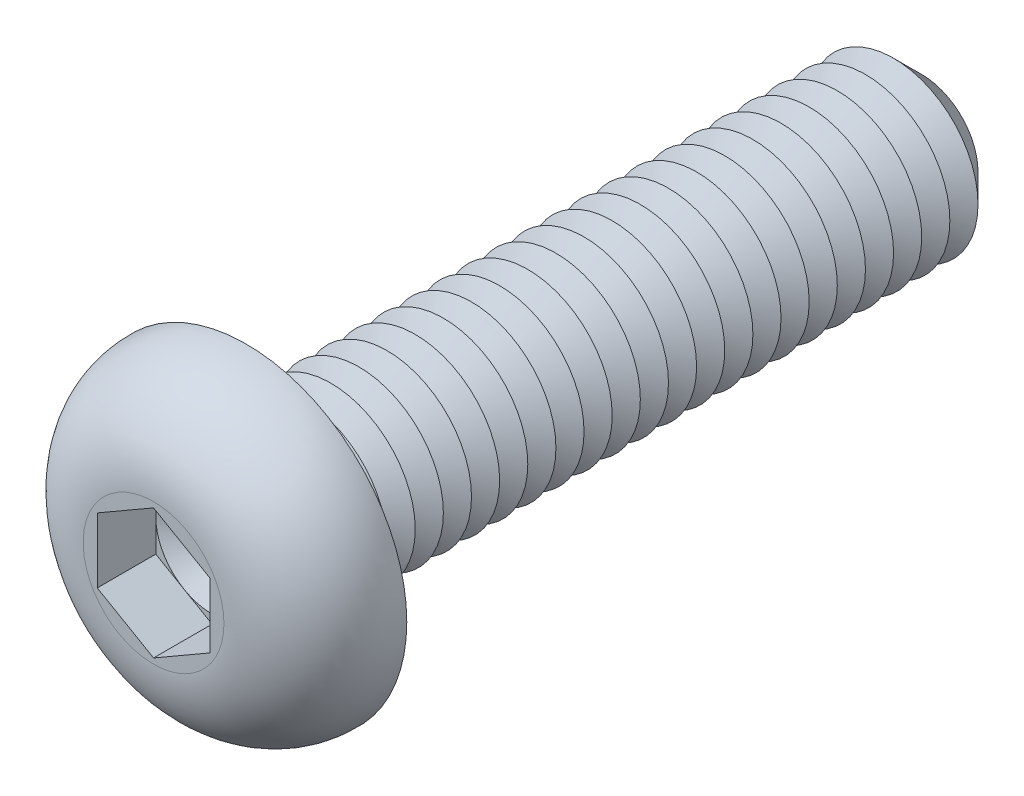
ISO-10303-21;
HEADER;
FILE_DESCRIPTION(('STEP AP214'),'2;1');
FILE_NAME('part.step','',(''),(''),'','','');
FILE_SCHEMA(('AUTOMOTIVE_DESIGN { 1 0 10303 214 1 1 1 1 }'));
ENDSEC;
DATA;
#1=APPLICATION_CONTEXT('core data for automotive mechanical design processes');
#2=APPLICATION_PROTOCOL_DEFINITION('international standard','automotive_design',2000,#1);
#3=PRODUCT_CONTEXT('',#1,'mechanical');
#4=PRODUCT('Part','Part','',(#3));
#5=PRODUCT_RELATED_PRODUCT_CATEGORY('part','',(#4));
#6=PRODUCT_DEFINITION_FORMATION('','',#4);
#7=PRODUCT_DEFINITION_CONTEXT('part definition',#1,'design');
#8=PRODUCT_DEFINITION('design','',#6,#7);
#9=PRODUCT_DEFINITION_SHAPE('','',#8);
#10=(LENGTH_UNIT() NAMED_UNIT(*) SI_UNIT(.MILLI.,.METRE.));
#11=(NAMED_UNIT(*) PLANE_ANGLE_UNIT() SI_UNIT($,.RADIAN.));
#12=(NAMED_UNIT(*) SI_UNIT($,.STERADIAN.) SOLID_ANGLE_UNIT());
#13=UNCERTAINTY_MEASURE_WITH_UNIT(LENGTH_MEASURE(1.E-05),#10,'distance_accuracy_value','');
#14=(GEOMETRIC_REPRESENTATION_CONTEXT(3) GLOBAL_UNCERTAINTY_ASSIGNED_CONTEXT((#13)) GLOBAL_UNIT_ASSIGNED_CONTEXT((#10,
#11,#12)) REPRESENTATION_CONTEXT('',''));
#15=CARTESIAN_POINT('',(0.,0.,0.));
#16=DIRECTION('',(0.,0.,1.));
#17=DIRECTION('',(1.,0.,0.));
#18=AXIS2_PLACEMENT_3D('',#15,#16,#17);
#19=CARTESIAN_POINT('',(0.,0.,0.61));
#20=DIRECTION('',(0.,0.,1.));
#21=DIRECTION('',(1.,0.,0.));
#22=AXIS2_PLACEMENT_3D('',#19,#20,#21);
#23=PLANE('',#22);
#24=CARTESIAN_POINT('',(0.,0.,0.61));
#25=DIRECTION('',(0.,0.,1.));
#26=DIRECTION('',(1.,0.,0.));
#27=AXIS2_PLACEMENT_3D('',#24,#25,#26);
#28=CIRCLE('',#27,1.);
#29=CARTESIAN_POINT('',(1.,0.,0.61));
#30=VERTEX_POINT('',#29);
#31=CARTESIAN_POINT('',(0.5,0.866025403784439,0.61));
#32=VERTEX_POINT('',#31);
#33=EDGE_CURVE('E117',#30,#32,#28,.T.);
#34=ORIENTED_EDGE('',*,*,#33,.F.);
#35=DIRECTION('',(0.,1.,0.));
#36=VECTOR('',#35,1.);
#37=CARTESIAN_POINT('',(1.,-0.577350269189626,0.61));
#38=LINE('',#37,#36);
#39=CARTESIAN_POINT('',(1.,0.577350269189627,0.61));
#40=VERTEX_POINT('',#39);
#41=EDGE_CURVE('E140',#30,#40,#38,.T.);
#42=ORIENTED_EDGE('',*,*,#41,.T.);
#43=DIRECTION('',(-0.866025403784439,0.5,0.));
#44=VECTOR('',#43,1.);
#45=CARTESIAN_POINT('',(1.,0.577350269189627,0.61));
#46=LINE('',#45,#44);
#47=EDGE_CURVE('E135',#40,#32,#46,.T.);
#48=ORIENTED_EDGE('',*,*,#47,.T.);
#49=EDGE_LOOP('',(#34,#42,#48));
#50=FACE_BOUND('',#49,.T.);
#51=ADVANCED_FACE('F39',(#50),#23,.T.);
#52=CARTESIAN_POINT('',(0.,0.,0.61));
#53=DIRECTION('',(0.,0.,1.));
#54=DIRECTION('',(1.,0.,0.));
#55=AXIS2_PLACEMENT_3D('',#52,#53,#54);
#56=CIRCLE('',#55,1.);
#57=CARTESIAN_POINT('',(-0.5,0.866025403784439,0.61));
#58=VERTEX_POINT('',#57);
#59=EDGE_CURVE('E11',#32,#58,#56,.T.);
#60=ORIENTED_EDGE('',*,*,#59,.F.);
#61=CARTESIAN_POINT('',(0.,1.15470053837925,0.61));
#62=VERTEX_POINT('',#61);
#63=EDGE_CURVE('E130',#32,#62,#46,.T.);
#64=ORIENTED_EDGE('',*,*,#63,.T.);
#65=DIRECTION('',(-0.866025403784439,-0.5,0.));
#66=VECTOR('',#65,1.);
#67=CARTESIAN_POINT('',(0.,1.15470053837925,0.61));
#68=LINE('',#67,#66);
#69=EDGE_CURVE('E132',#62,#58,#68,.T.);
#70=ORIENTED_EDGE('',*,*,#69,.T.);
#71=EDGE_LOOP('',(#60,#64,#70));
#72=FACE_BOUND('',#71,.T.);
#73=ADVANCED_FACE('F129',(#72),#23,.T.);
#74=CARTESIAN_POINT('',(-1.,0.,0.61));
#75=VERTEX_POINT('',#74);
#76=EDGE_CURVE('E49',#58,#75,#56,.T.);
#77=ORIENTED_EDGE('',*,*,#76,.F.);
#78=CARTESIAN_POINT('',(-1.,0.577350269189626,0.61));
#79=VERTEX_POINT('',#78);
#80=EDGE_CURVE('E143',#58,#79,#68,.T.);
#81=ORIENTED_EDGE('',*,*,#80,.T.);
#82=DIRECTION('',(0.,-1.,0.));
#83=VECTOR('',#82,1.);
#84=CARTESIAN_POINT('',(-1.,0.577350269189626,0.61));
#85=LINE('',#84,#83);
#86=EDGE_CURVE('E154',#79,#75,#85,.T.);
#87=ORIENTED_EDGE('',*,*,#86,.T.);
#88=EDGE_LOOP('',(#77,#81,#87));
#89=FACE_BOUND('',#88,.T.);
#90=ADVANCED_FACE('F252',(#89),#23,.T.);
#91=CARTESIAN_POINT('',(-0.5,-0.866025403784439,0.61));
#92=VERTEX_POINT('',#91);
#93=EDGE_CURVE('E233',#75,#92,#56,.T.);
#94=ORIENTED_EDGE('',*,*,#93,.F.);
#95=CARTESIAN_POINT('',(-1.,-0.577350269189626,0.61));
#96=VERTEX_POINT('',#95);
#97=EDGE_CURVE('E153',#75,#96,#85,.T.);
#98=ORIENTED_EDGE('',*,*,#97,.T.);
#99=DIRECTION('',(0.866025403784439,-0.5,0.));
#100=VECTOR('',#99,1.);
#101=CARTESIAN_POINT('',(-1.,-0.577350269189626,0.61));
#102=LINE('',#101,#100);
#103=EDGE_CURVE('E159',#96,#92,#102,.T.);
#104=ORIENTED_EDGE('',*,*,#103,.T.);
#105=EDGE_LOOP('',(#94,#98,#104));
#106=FACE_BOUND('',#105,.T.);
#107=ADVANCED_FACE('F245',(#106),#23,.T.);
#108=CARTESIAN_POINT('',(0.5,-0.866025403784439,0.61));
#109=VERTEX_POINT('',#108);
#110=EDGE_CURVE('E56',#92,#109,#56,.T.);
#111=ORIENTED_EDGE('',*,*,#110,.F.);
#112=CARTESIAN_POINT('',(0.,-1.15470053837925,0.61));
#113=VERTEX_POINT('',#112);
#114=EDGE_CURVE('E158',#92,#113,#102,.T.);
#115=ORIENTED_EDGE('',*,*,#114,.T.);
#116=DIRECTION('',(0.866025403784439,0.5,0.));
#117=VECTOR('',#116,1.);
#118=CARTESIAN_POINT('',(0.,-1.15470053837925,0.61));
#119=LINE('',#118,#117);
#120=EDGE_CURVE('E164',#113,#109,#119,.T.);
#121=ORIENTED_EDGE('',*,*,#120,.T.);
#122=EDGE_LOOP('',(#111,#115,#121));
#123=FACE_BOUND('',#122,.T.);
#124=ADVANCED_FACE('F461',(#123),#23,.T.);
#125=CARTESIAN_POINT('',(0.,0.,-12.));
#126=DIRECTION('',(0.,0.,1.));
#127=DIRECTION('',(1.,0.,0.));
#128=AXIS2_PLACEMENT_3D('',#125,#126,#127);
#129=CYLINDRICAL_SURFACE('',#128,1.5);
#130=CARTESIAN_POINT('',(0.,0.,-0.200000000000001));
#131=DIRECTION('',(0.,0.,1.));
#132=DIRECTION('',(1.,0.,0.));
#133=AXIS2_PLACEMENT_3D('',#130,#131,#132);
#134=CIRCLE('',#133,1.5);
#135=CARTESIAN_POINT('',(1.5,0.,-0.200000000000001));
#136=VERTEX_POINT('',#135);
#137=EDGE_CURVE('E221',#136,#136,#134,.F.);
#138=ORIENTED_EDGE('',*,*,#137,.T.);
#139=EDGE_LOOP('',(#138));
#140=FACE_BOUND('',#139,.T.);
#141=CARTESIAN_POINT('',(0.,0.,-0.5));
#142=DIRECTION('',(0.,0.,1.));
#143=DIRECTION('',(1.,0.,0.));
#144=AXIS2_PLACEMENT_3D('',#141,#142,#143);
#145=CIRCLE('',#144,1.50000000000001);
#146=CARTESIAN_POINT('',(1.50000000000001,0.,-0.5));
#147=VERTEX_POINT('',#146);
#148=EDGE_CURVE('E149',#147,#147,#145,.T.);
#149=ORIENTED_EDGE('',*,*,#148,.T.);
#150=EDGE_LOOP('',(#149));
#151=FACE_BOUND('',#150,.T.);
#152=ADVANCED_FACE('F445',(#140,#151),#129,.T.);
#153=CARTESIAN_POINT('',(0.,2.85,0.));
#154=DIRECTION('',(0.,0.,1.));
#155=DIRECTION('',(1.,0.,0.));
#156=AXIS2_PLACEMENT_3D('',#153,#154,#155);
#157=PLANE('',#156);
#158=CARTESIAN_POINT('',(0.,0.,0.));
#159=DIRECTION('',(0.,0.,1.));
#160=DIRECTION('',(1.,0.,0.));
#161=AXIS2_PLACEMENT_3D('',#158,#159,#160);
#162=CIRCLE('',#161,1.7);
#163=CARTESIAN_POINT('',(1.7,0.,0.));
#164=VERTEX_POINT('',#163);
#165=EDGE_CURVE('E224',#164,#164,#162,.T.);
#166=ORIENTED_EDGE('',*,*,#165,.T.);
#167=EDGE_LOOP('',(#166));
#168=FACE_BOUND('',#167,.T.);
#169=CARTESIAN_POINT('',(0.,0.,0.));
#170=DIRECTION('',(0.,0.,1.));
#171=DIRECTION('',(1.,0.,0.));
#172=AXIS2_PLACEMENT_3D('',#169,#170,#171);
#173=CIRCLE('',#172,2.85);
#174=CARTESIAN_POINT('',(2.85,0.,0.));
#175=VERTEX_POINT('',#174);
#176=EDGE_CURVE('E196',#175,#175,#173,.T.);
#177=ORIENTED_EDGE('',*,*,#176,.F.);
#178=EDGE_LOOP('',(#177));
#179=FACE_BOUND('',#178,.T.);
#180=ADVANCED_FACE('F491',(#168,#179),#157,.F.);
#181=CARTESIAN_POINT('',(0.,0.,1.65));
#182=DIRECTION('',(0.,0.,-1.));
#183=DIRECTION('',(-1.,0.,0.));
#184=AXIS2_PLACEMENT_3D('',#181,#182,#183);
#185=PLANE('',#184);
#186=DIRECTION('',(-0.866025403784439,-0.5,0.));
#187=VECTOR('',#186,1.);
#188=CARTESIAN_POINT('',(0.,1.15470053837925,1.65));
#189=LINE('',#188,#187);
#190=CARTESIAN_POINT('',(0.,1.15470053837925,1.65));
#191=VERTEX_POINT('',#190);
#192=CARTESIAN_POINT('',(-1.,0.577350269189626,1.65));
#193=VERTEX_POINT('',#192);
#194=EDGE_CURVE('E174',#191,#193,#189,.T.);
#195=ORIENTED_EDGE('',*,*,#194,.F.);
#196=DIRECTION('',(-0.866025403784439,0.5,0.));
#197=VECTOR('',#196,1.);
#198=CARTESIAN_POINT('',(1.,0.577350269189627,1.65));
#199=LINE('',#198,#197);
#200=CARTESIAN_POINT('',(1.,0.577350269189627,1.65));
#201=VERTEX_POINT('',#200);
#202=EDGE_CURVE('E64',#201,#191,#199,.T.);
#203=ORIENTED_EDGE('',*,*,#202,.F.);
#204=DIRECTION('',(0.,1.,0.));
#205=VECTOR('',#204,1.);
#206=CARTESIAN_POINT('',(1.,-0.577350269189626,1.65));
#207=LINE('',#206,#205);
#208=CARTESIAN_POINT('',(1.,-0.577350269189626,1.65));
#209=VERTEX_POINT('',#208);
#210=EDGE_CURVE('E138',#209,#201,#207,.T.);
#211=ORIENTED_EDGE('',*,*,#210,.F.);
#212=DIRECTION('',(0.866025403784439,0.5,0.));
#213=VECTOR('',#212,1.);
#214=CARTESIAN_POINT('',(0.,-1.15470053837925,1.65));
#215=LINE('',#214,#213);
#216=CARTESIAN_POINT('',(0.,-1.15470053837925,1.65));
#217=VERTEX_POINT('',#216);
#218=EDGE_CURVE('E186',#217,#209,#215,.T.);
#219=ORIENTED_EDGE('',*,*,#218,.F.);
#220=DIRECTION('',(0.866025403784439,-0.5,0.));
#221=VECTOR('',#220,1.);
#222=CARTESIAN_POINT('',(-1.,-0.577350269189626,1.65));
#223=LINE('',#222,#221);
#224=CARTESIAN_POINT('',(-1.,-0.577350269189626,1.65));
#225=VERTEX_POINT('',#224);
#226=EDGE_CURVE('E182',#225,#217,#223,.T.);
#227=ORIENTED_EDGE('',*,*,#226,.F.);
#228=DIRECTION('',(0.,-1.,0.));
#229=VECTOR('',#228,1.);
#230=CARTESIAN_POINT('',(-1.,0.577350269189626,1.65));
#231=LINE('',#230,#229);
#232=EDGE_CURVE('E178',#193,#225,#231,.T.);
#233=ORIENTED_EDGE('',*,*,#232,.F.);
#234=EDGE_LOOP('',(#195,#203,#211,#219,#227,#233));
#235=FACE_BOUND('',#234,.T.);
#236=CARTESIAN_POINT('',(0.,0.,1.65));
#237=DIRECTION('',(0.,0.,1.));
#238=DIRECTION('',(1.,0.,0.));
#239=AXIS2_PLACEMENT_3D('',#236,#237,#238);
#240=CIRCLE('',#239,1.25078144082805);
#241=CARTESIAN_POINT('',(1.25078144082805,0.,1.65));
#242=VERTEX_POINT('',#241);
#243=EDGE_CURVE('E213',#242,#242,#240,.T.);
#244=ORIENTED_EDGE('',*,*,#243,.T.);
#245=EDGE_LOOP('',(#244));
#246=FACE_BOUND('',#245,.T.);
#247=ADVANCED_FACE('F261',(#235,#246),#185,.F.);
#248=CARTESIAN_POINT('',(0.,0.,0.0499999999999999));
#249=DIRECTION('',(0.,0.,1.));
#250=DIRECTION('',(1.,0.,0.));
#251=AXIS2_PLACEMENT_3D('',#248,#249,#250);
#252=DEGENERATE_TOROIDAL_SURFACE('',#251,1.25078144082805,1.6,.T.);
#253=ORIENTED_EDGE('',*,*,#243,.F.);
#254=EDGE_LOOP('',(#253));
#255=FACE_BOUND('',#254,.T.);
#256=ORIENTED_EDGE('',*,*,#176,.T.);
#257=EDGE_LOOP('',(#256));
#258=FACE_BOUND('',#257,.T.);
#259=ADVANCED_FACE('F485',(#255,#258),#252,.T.);
#260=CARTESIAN_POINT('',(1.,0.577350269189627,0.61));
#261=DIRECTION('',(0.5,0.866025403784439,0.));
#262=DIRECTION('',(-0.866025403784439,0.5,0.));
#263=AXIS2_PLACEMENT_3D('',#260,#261,#262);
#264=PLANE('',#263);
#265=ORIENTED_EDGE('',*,*,#202,.T.);
#266=DIRECTION('',(0.,0.,1.));
#267=VECTOR('',#266,1.);
#268=CARTESIAN_POINT('',(0.,1.15470053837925,0.61));
#269=LINE('',#268,#267);
#270=EDGE_CURVE('E136',#62,#191,#269,.T.);
#271=ORIENTED_EDGE('',*,*,#270,.F.);
#272=ORIENTED_EDGE('',*,*,#63,.F.);
#273=ORIENTED_EDGE('',*,*,#47,.F.);
#274=DIRECTION('',(0.,0.,1.));
#275=VECTOR('',#274,1.);
#276=CARTESIAN_POINT('',(1.,0.577350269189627,0.61));
#277=LINE('',#276,#275);
#278=EDGE_CURVE('E193',#40,#201,#277,.T.);
#279=ORIENTED_EDGE('',*,*,#278,.T.);
#280=EDGE_LOOP('',(#265,#271,#272,#273,#279));
#281=FACE_BOUND('',#280,.T.);
#282=ADVANCED_FACE('F134',(#281),#264,.F.);
#283=CARTESIAN_POINT('',(1.,-0.577350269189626,0.61));
#284=DIRECTION('',(1.,0.,0.));
#285=DIRECTION('',(0.,0.,-1.));
#286=AXIS2_PLACEMENT_3D('',#283,#284,#285);
#287=PLANE('',#286);
#288=ORIENTED_EDGE('',*,*,#210,.T.);
#289=ORIENTED_EDGE('',*,*,#278,.F.);
#290=ORIENTED_EDGE('',*,*,#41,.F.);
#291=CARTESIAN_POINT('',(1.,-0.577350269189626,0.61));
#292=VERTEX_POINT('',#291);
#293=EDGE_CURVE('E168',#292,#30,#38,.T.);
#294=ORIENTED_EDGE('',*,*,#293,.F.);
#295=DIRECTION('',(0.,0.,1.));
#296=VECTOR('',#295,1.);
#297=CARTESIAN_POINT('',(1.,-0.577350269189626,0.61));
#298=LINE('',#297,#296);
#299=EDGE_CURVE('E197',#292,#209,#298,.T.);
#300=ORIENTED_EDGE('',*,*,#299,.T.);
#301=EDGE_LOOP('',(#288,#289,#290,#294,#300));
#302=FACE_BOUND('',#301,.T.);
#303=ADVANCED_FACE('F469',(#302),#287,.F.);
#304=CARTESIAN_POINT('',(0.,-1.15470053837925,0.61));
#305=DIRECTION('',(0.5,-0.866025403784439,0.));
#306=DIRECTION('',(0.866025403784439,0.5,0.));
#307=AXIS2_PLACEMENT_3D('',#304,#305,#306);
#308=PLANE('',#307);
#309=ORIENTED_EDGE('',*,*,#218,.T.);
#310=ORIENTED_EDGE('',*,*,#299,.F.);
#311=EDGE_CURVE('E163',#109,#292,#119,.T.);
#312=ORIENTED_EDGE('',*,*,#311,.F.);
#313=ORIENTED_EDGE('',*,*,#120,.F.);
#314=DIRECTION('',(0.,0.,1.));
#315=VECTOR('',#314,1.);
#316=CARTESIAN_POINT('',(0.,-1.15470053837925,0.61));
#317=LINE('',#316,#315);
#318=EDGE_CURVE('E200',#113,#217,#317,.T.);
#319=ORIENTED_EDGE('',*,*,#318,.T.);
#320=EDGE_LOOP('',(#309,#310,#312,#313,#319));
#321=FACE_BOUND('',#320,.T.);
#322=ADVANCED_FACE('F472',(#321),#308,.F.);
#323=CARTESIAN_POINT('',(-1.,-0.577350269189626,0.61));
#324=DIRECTION('',(-0.5,-0.866025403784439,0.));
#325=DIRECTION('',(0.866025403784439,-0.5,0.));
#326=AXIS2_PLACEMENT_3D('',#323,#324,#325);
#327=PLANE('',#326);
#328=ORIENTED_EDGE('',*,*,#226,.T.);
#329=ORIENTED_EDGE('',*,*,#318,.F.);
#330=ORIENTED_EDGE('',*,*,#114,.F.);
#331=ORIENTED_EDGE('',*,*,#103,.F.);
#332=DIRECTION('',(0.,0.,1.));
#333=VECTOR('',#332,1.);
#334=CARTESIAN_POINT('',(-1.,-0.577350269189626,0.61));
#335=LINE('',#334,#333);
#336=EDGE_CURVE('E203',#96,#225,#335,.T.);
#337=ORIENTED_EDGE('',*,*,#336,.T.);
#338=EDGE_LOOP('',(#328,#329,#330,#331,#337));
#339=FACE_BOUND('',#338,.T.);
#340=ADVANCED_FACE('F266',(#339),#327,.F.);
#341=CARTESIAN_POINT('',(-1.,0.577350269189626,0.61));
#342=DIRECTION('',(-1.,0.,0.));
#343=DIRECTION('',(0.,-1.,0.));
#344=AXIS2_PLACEMENT_3D('',#341,#342,#343);
#345=PLANE('',#344);
#346=ORIENTED_EDGE('',*,*,#232,.T.);
#347=ORIENTED_EDGE('',*,*,#336,.F.);
#348=ORIENTED_EDGE('',*,*,#97,.F.);
#349=ORIENTED_EDGE('',*,*,#86,.F.);
#350=DIRECTION('',(0.,0.,1.));
#351=VECTOR('',#350,1.);
#352=CARTESIAN_POINT('',(-1.,0.577350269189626,0.61));
#353=LINE('',#352,#351);
#354=EDGE_CURVE('E206',#79,#193,#353,.T.);
#355=ORIENTED_EDGE('',*,*,#354,.T.);
#356=EDGE_LOOP('',(#346,#347,#348,#349,#355));
#357=FACE_BOUND('',#356,.T.);
#358=ADVANCED_FACE('F250',(#357),#345,.F.);
#359=CARTESIAN_POINT('',(0.,1.15470053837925,0.61));
#360=DIRECTION('',(-0.5,0.866025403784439,0.));
#361=DIRECTION('',(-0.866025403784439,-0.5,0.));
#362=AXIS2_PLACEMENT_3D('',#359,#360,#361);
#363=PLANE('',#362);
#364=ORIENTED_EDGE('',*,*,#194,.T.);
#365=ORIENTED_EDGE('',*,*,#354,.F.);
#366=ORIENTED_EDGE('',*,*,#80,.F.);
#367=ORIENTED_EDGE('',*,*,#69,.F.);
#368=ORIENTED_EDGE('',*,*,#270,.T.);
#369=EDGE_LOOP('',(#364,#365,#366,#367,#368));
#370=FACE_BOUND('',#369,.T.);
#371=ADVANCED_FACE('F255',(#370),#363,.F.);
#372=EDGE_CURVE('E43',#109,#30,#56,.T.);
#373=ORIENTED_EDGE('',*,*,#372,.F.);
#374=ORIENTED_EDGE('',*,*,#311,.T.);
#375=ORIENTED_EDGE('',*,*,#293,.T.);
#376=EDGE_LOOP('',(#373,#374,#375));
#377=FACE_BOUND('',#376,.T.);
#378=ADVANCED_FACE('F450',(#377),#23,.T.);
#379=CARTESIAN_POINT('',(0.,0.,-0.5));
#380=DIRECTION('',(0.,0.,1.));
#381=DIRECTION('',(1.,0.,0.));
#382=AXIS2_PLACEMENT_3D('',#379,#380,#381);
#383=CONICAL_SURFACE('',#382,1.50000000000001,1.0471975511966);
#384=CARTESIAN_POINT('',(0.,0.,-0.750000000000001));
#385=DIRECTION('',(0.,0.,1.));
#386=DIRECTION('',(1.,0.,0.));
#387=AXIS2_PLACEMENT_3D('',#384,#385,#386);
#388=CIRCLE('',#387,1.06698729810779);
#389=CARTESIAN_POINT('',(1.06698729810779,0.,-0.750000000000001));
#390=VERTEX_POINT('',#389);
#391=EDGE_CURVE('E436',#390,#390,#388,.T.);
#392=ORIENTED_EDGE('',*,*,#391,.T.);
#393=EDGE_LOOP('',(#392));
#394=FACE_BOUND('',#393,.T.);
#395=ORIENTED_EDGE('',*,*,#148,.F.);
#396=EDGE_LOOP('',(#395));
#397=FACE_BOUND('',#396,.T.);
#398=ADVANCED_FACE('F447',(#394,#397),#383,.T.);
#399=CARTESIAN_POINT('',(0.,0.,-0.750000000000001));
#400=DIRECTION('',(0.,0.,-1.));
#401=DIRECTION('',(-1.,0.,0.));
#402=AXIS2_PLACEMENT_3D('',#399,#400,#401);
#403=CONICAL_SURFACE('',#402,1.06698729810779,1.0471975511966);
#404=CARTESIAN_POINT('',(0.,0.,-1.));
#405=DIRECTION('',(0.,0.,1.));
#406=DIRECTION('',(1.,0.,0.));
#407=AXIS2_PLACEMENT_3D('',#404,#405,#406);
#408=CIRCLE('',#407,1.50000000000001);
#409=CARTESIAN_POINT('',(1.50000000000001,0.,-1.));
#410=VERTEX_POINT('',#409);
#411=EDGE_CURVE('E433',#410,#410,#408,.T.);
#412=ORIENTED_EDGE('',*,*,#411,.T.);
#413=EDGE_LOOP('',(#412));
#414=FACE_BOUND('',#413,.T.);
#415=ORIENTED_EDGE('',*,*,#391,.F.);
#416=EDGE_LOOP('',(#415));
#417=FACE_BOUND('',#416,.T.);
#418=ADVANCED_FACE('F449',(#414,#417),#403,.T.);
#419=CARTESIAN_POINT('',(0.,0.,-1.));
#420=DIRECTION('',(0.,0.,1.));
#421=DIRECTION('',(1.,0.,0.));
#422=AXIS2_PLACEMENT_3D('',#419,#420,#421);
#423=CONICAL_SURFACE('',#422,1.50000000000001,1.0471975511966);
#424=CARTESIAN_POINT('',(0.,0.,-1.25));
#425=DIRECTION('',(0.,0.,1.));
#426=DIRECTION('',(1.,0.,0.));
#427=AXIS2_PLACEMENT_3D('',#424,#425,#426);
#428=CIRCLE('',#427,1.06698729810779);
#429=CARTESIAN_POINT('',(1.06698729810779,0.,-1.25));
#430=VERTEX_POINT('',#429);
#431=EDGE_CURVE('E429',#430,#430,#428,.T.);
#432=ORIENTED_EDGE('',*,*,#431,.T.);
#433=EDGE_LOOP('',(#432));
#434=FACE_BOUND('',#433,.T.);
#435=ORIENTED_EDGE('',*,*,#411,.F.);
#436=EDGE_LOOP('',(#435));
#437=FACE_BOUND('',#436,.T.);
#438=ADVANCED_FACE('F456',(#434,#437),#423,.T.);
#439=CARTESIAN_POINT('',(0.,0.,-1.25));
#440=DIRECTION('',(0.,0.,-1.));
#441=DIRECTION('',(-1.,0.,0.));
#442=AXIS2_PLACEMENT_3D('',#439,#440,#441);
#443=CONICAL_SURFACE('',#442,1.06698729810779,1.0471975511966);
#444=CARTESIAN_POINT('',(0.,0.,-1.5));
#445=DIRECTION('',(0.,0.,1.));
#446=DIRECTION('',(1.,0.,0.));
#447=AXIS2_PLACEMENT_3D('',#444,#445,#446);
#448=CIRCLE('',#447,1.50000000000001);
#449=CARTESIAN_POINT('',(1.50000000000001,0.,-1.5));
#450=VERTEX_POINT('',#449);
#451=EDGE_CURVE('E425',#450,#450,#448,.T.);
#452=ORIENTED_EDGE('',*,*,#451,.T.);
#453=EDGE_LOOP('',(#452));
#454=FACE_BOUND('',#453,.T.);
#455=ORIENTED_EDGE('',*,*,#431,.F.);
#456=EDGE_LOOP('',(#455));
#457=FACE_BOUND('',#456,.T.);
#458=ADVANCED_FACE('F672',(#454,#457),#443,.T.);
#459=CARTESIAN_POINT('',(0.,0.,-1.5));
#460=DIRECTION('',(0.,0.,1.));
#461=DIRECTION('',(1.,0.,0.));
#462=AXIS2_PLACEMENT_3D('',#459,#460,#461);
#463=CONICAL_SURFACE('',#462,1.50000000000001,1.0471975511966);
#464=CARTESIAN_POINT('',(0.,0.,-1.75));
#465=DIRECTION('',(0.,0.,1.));
#466=DIRECTION('',(1.,0.,0.));
#467=AXIS2_PLACEMENT_3D('',#464,#465,#466);
#468=CIRCLE('',#467,1.06698729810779);
#469=CARTESIAN_POINT('',(1.06698729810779,0.,-1.75));
#470=VERTEX_POINT('',#469);
#471=EDGE_CURVE('E422',#470,#470,#468,.T.);
#472=ORIENTED_EDGE('',*,*,#471,.T.);
#473=EDGE_LOOP('',(#472));
#474=FACE_BOUND('',#473,.T.);
#475=ORIENTED_EDGE('',*,*,#451,.F.);
#476=EDGE_LOOP('',(#475));
#477=FACE_BOUND('',#476,.T.);
#478=ADVANCED_FACE('F668',(#474,#477),#463,.T.);
#479=CARTESIAN_POINT('',(0.,0.,-1.75));
#480=DIRECTION('',(0.,0.,-1.));
#481=DIRECTION('',(-1.,0.,0.));
#482=AXIS2_PLACEMENT_3D('',#479,#480,#481);
#483=CONICAL_SURFACE('',#482,1.06698729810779,1.0471975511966);
#484=CARTESIAN_POINT('',(0.,0.,-2.));
#485=DIRECTION('',(0.,0.,1.));
#486=DIRECTION('',(1.,0.,0.));
#487=AXIS2_PLACEMENT_3D('',#484,#485,#486);
#488=CIRCLE('',#487,1.50000000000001);
#489=CARTESIAN_POINT('',(1.50000000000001,0.,-2.));
#490=VERTEX_POINT('',#489);
#491=EDGE_CURVE('E418',#490,#490,#488,.T.);
#492=ORIENTED_EDGE('',*,*,#491,.T.);
#493=EDGE_LOOP('',(#492));
#494=FACE_BOUND('',#493,.T.);
#495=ORIENTED_EDGE('',*,*,#471,.F.);
#496=EDGE_LOOP('',(#495));
#497=FACE_BOUND('',#496,.T.);
#498=ADVANCED_FACE('F664',(#494,#497),#483,.T.);
#499=CARTESIAN_POINT('',(0.,0.,-2.));
#500=DIRECTION('',(0.,0.,1.));
#501=DIRECTION('',(1.,0.,0.));
#502=AXIS2_PLACEMENT_3D('',#499,#500,#501);
#503=CONICAL_SURFACE('',#502,1.50000000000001,1.0471975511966);
#504=CARTESIAN_POINT('',(0.,0.,-2.25));
#505=DIRECTION('',(0.,0.,1.));
#506=DIRECTION('',(1.,0.,0.));
#507=AXIS2_PLACEMENT_3D('',#504,#505,#506);
#508=CIRCLE('',#507,1.06698729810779);
#509=CARTESIAN_POINT('',(1.06698729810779,0.,-2.25));
#510=VERTEX_POINT('',#509);
#511=EDGE_CURVE('E414',#510,#510,#508,.T.);
#512=ORIENTED_EDGE('',*,*,#511,.T.);
#513=EDGE_LOOP('',(#512));
#514=FACE_BOUND('',#513,.T.);
#515=ORIENTED_EDGE('',*,*,#491,.F.);
#516=EDGE_LOOP('',(#515));
#517=FACE_BOUND('',#516,.T.);
#518=ADVANCED_FACE('F660',(#514,#517),#503,.T.);
#519=CARTESIAN_POINT('',(0.,0.,-2.25));
#520=DIRECTION('',(0.,0.,-1.));
#521=DIRECTION('',(-1.,0.,0.));
#522=AXIS2_PLACEMENT_3D('',#519,#520,#521);
#523=CONICAL_SURFACE('',#522,1.06698729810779,1.0471975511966);
#524=CARTESIAN_POINT('',(0.,0.,-2.5));
#525=DIRECTION('',(0.,0.,1.));
#526=DIRECTION('',(1.,0.,0.));
#527=AXIS2_PLACEMENT_3D('',#524,#525,#526);
#528=CIRCLE('',#527,1.50000000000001);
#529=CARTESIAN_POINT('',(1.50000000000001,0.,-2.5));
#530=VERTEX_POINT('',#529);
#531=EDGE_CURVE('E410',#530,#530,#528,.T.);
#532=ORIENTED_EDGE('',*,*,#531,.T.);
#533=EDGE_LOOP('',(#532));
#534=FACE_BOUND('',#533,.T.);
#535=ORIENTED_EDGE('',*,*,#511,.F.);
#536=EDGE_LOOP('',(#535));
#537=FACE_BOUND('',#536,.T.);
#538=ADVANCED_FACE('F656',(#534,#537),#523,.T.);
#539=CARTESIAN_POINT('',(0.,0.,-2.5));
#540=DIRECTION('',(0.,0.,1.));
#541=DIRECTION('',(1.,0.,0.));
#542=AXIS2_PLACEMENT_3D('',#539,#540,#541);
#543=CONICAL_SURFACE('',#542,1.50000000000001,1.0471975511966);
#544=CARTESIAN_POINT('',(0.,0.,-2.75));
#545=DIRECTION('',(0.,0.,1.));
#546=DIRECTION('',(1.,0.,0.));
#547=AXIS2_PLACEMENT_3D('',#544,#545,#546);
#548=CIRCLE('',#547,1.06698729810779);
#549=CARTESIAN_POINT('',(1.06698729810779,0.,-2.75));
#550=VERTEX_POINT('',#549);
#551=EDGE_CURVE('E406',#550,#550,#548,.T.);
#552=ORIENTED_EDGE('',*,*,#551,.T.);
#553=EDGE_LOOP('',(#552));
#554=FACE_BOUND('',#553,.T.);
#555=ORIENTED_EDGE('',*,*,#531,.F.);
#556=EDGE_LOOP('',(#555));
#557=FACE_BOUND('',#556,.T.);
#558=ADVANCED_FACE('F652',(#554,#557),#543,.T.);
#559=CARTESIAN_POINT('',(0.,0.,-2.75));
#560=DIRECTION('',(0.,0.,-1.));
#561=DIRECTION('',(-1.,0.,0.));
#562=AXIS2_PLACEMENT_3D('',#559,#560,#561);
#563=CONICAL_SURFACE('',#562,1.06698729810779,1.0471975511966);
#564=CARTESIAN_POINT('',(0.,0.,-3.));
#565=DIRECTION('',(0.,0.,1.));
#566=DIRECTION('',(1.,0.,0.));
#567=AXIS2_PLACEMENT_3D('',#564,#565,#566);
#568=CIRCLE('',#567,1.50000000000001);
#569=CARTESIAN_POINT('',(1.50000000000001,0.,-3.));
#570=VERTEX_POINT('',#569);
#571=EDGE_CURVE('E402',#570,#570,#568,.T.);
#572=ORIENTED_EDGE('',*,*,#571,.T.);
#573=EDGE_LOOP('',(#572));
#574=FACE_BOUND('',#573,.T.);
#575=ORIENTED_EDGE('',*,*,#551,.F.);
#576=EDGE_LOOP('',(#575));
#577=FACE_BOUND('',#576,.T.);
#578=ADVANCED_FACE('F648',(#574,#577),#563,.T.);
#579=CARTESIAN_POINT('',(0.,0.,-3.));
#580=DIRECTION('',(0.,0.,1.));
#581=DIRECTION('',(1.,0.,0.));
#582=AXIS2_PLACEMENT_3D('',#579,#580,#581);
#583=CONICAL_SURFACE('',#582,1.50000000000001,1.0471975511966);
#584=CARTESIAN_POINT('',(0.,0.,-3.25));
#585=DIRECTION('',(0.,0.,1.));
#586=DIRECTION('',(1.,0.,0.));
#587=AXIS2_PLACEMENT_3D('',#584,#585,#586);
#588=CIRCLE('',#587,1.06698729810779);
#589=CARTESIAN_POINT('',(1.06698729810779,0.,-3.25));
#590=VERTEX_POINT('',#589);
#591=EDGE_CURVE('E398',#590,#590,#588,.T.);
#592=ORIENTED_EDGE('',*,*,#591,.T.);
#593=EDGE_LOOP('',(#592));
#594=FACE_BOUND('',#593,.T.);
#595=ORIENTED_EDGE('',*,*,#571,.F.);
#596=EDGE_LOOP('',(#595));
#597=FACE_BOUND('',#596,.T.);
#598=ADVANCED_FACE('F644',(#594,#597),#583,.T.);
#599=CARTESIAN_POINT('',(0.,0.,-3.25));
#600=DIRECTION('',(0.,0.,-1.));
#601=DIRECTION('',(-1.,0.,0.));
#602=AXIS2_PLACEMENT_3D('',#599,#600,#601);
#603=CONICAL_SURFACE('',#602,1.06698729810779,1.0471975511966);
#604=CARTESIAN_POINT('',(0.,0.,-3.5));
#605=DIRECTION('',(0.,0.,1.));
#606=DIRECTION('',(1.,0.,0.));
#607=AXIS2_PLACEMENT_3D('',#604,#605,#606);
#608=CIRCLE('',#607,1.50000000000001);
#609=CARTESIAN_POINT('',(1.50000000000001,0.,-3.5));
#610=VERTEX_POINT('',#609);
#611=EDGE_CURVE('E272',#610,#610,#608,.T.);
#612=ORIENTED_EDGE('',*,*,#611,.T.);
#613=EDGE_LOOP('',(#612));
#614=FACE_BOUND('',#613,.T.);
#615=ORIENTED_EDGE('',*,*,#591,.F.);
#616=EDGE_LOOP('',(#615));
#617=FACE_BOUND('',#616,.T.);
#618=ADVANCED_FACE('F640',(#614,#617),#603,.T.);
#619=CARTESIAN_POINT('',(0.,0.,-3.5));
#620=DIRECTION('',(0.,0.,1.));
#621=DIRECTION('',(1.,0.,0.));
#622=AXIS2_PLACEMENT_3D('',#619,#620,#621);
#623=CONICAL_SURFACE('',#622,1.50000000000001,1.0471975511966);
#624=CARTESIAN_POINT('',(0.,0.,-3.75));
#625=DIRECTION('',(0.,0.,1.));
#626=DIRECTION('',(1.,0.,0.));
#627=AXIS2_PLACEMENT_3D('',#624,#625,#626);
#628=CIRCLE('',#627,1.06698729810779);
#629=CARTESIAN_POINT('',(1.06698729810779,0.,-3.75));
#630=VERTEX_POINT('',#629);
#631=EDGE_CURVE('E392',#630,#630,#628,.T.);
#632=ORIENTED_EDGE('',*,*,#631,.T.);
#633=EDGE_LOOP('',(#632));
#634=FACE_BOUND('',#633,.T.);
#635=ORIENTED_EDGE('',*,*,#611,.F.);
#636=EDGE_LOOP('',(#635));
#637=FACE_BOUND('',#636,.T.);
#638=ADVANCED_FACE('F636',(#634,#637),#623,.T.);
#639=CARTESIAN_POINT('',(0.,0.,-3.75));
#640=DIRECTION('',(0.,0.,-1.));
#641=DIRECTION('',(-1.,0.,0.));
#642=AXIS2_PLACEMENT_3D('',#639,#640,#641);
#643=CONICAL_SURFACE('',#642,1.06698729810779,1.0471975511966);
#644=CARTESIAN_POINT('',(0.,0.,-4.));
#645=DIRECTION('',(0.,0.,1.));
#646=DIRECTION('',(1.,0.,0.));
#647=AXIS2_PLACEMENT_3D('',#644,#645,#646);
#648=CIRCLE('',#647,1.50000000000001);
#649=CARTESIAN_POINT('',(1.50000000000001,0.,-4.));
#650=VERTEX_POINT('',#649);
#651=EDGE_CURVE('E388',#650,#650,#648,.T.);
#652=ORIENTED_EDGE('',*,*,#651,.T.);
#653=EDGE_LOOP('',(#652));
#654=FACE_BOUND('',#653,.T.);
#655=ORIENTED_EDGE('',*,*,#631,.F.);
#656=EDGE_LOOP('',(#655));
#657=FACE_BOUND('',#656,.T.);
#658=ADVANCED_FACE('F632',(#654,#657),#643,.T.);
#659=CARTESIAN_POINT('',(0.,0.,-4.));
#660=DIRECTION('',(0.,0.,1.));
#661=DIRECTION('',(1.,0.,0.));
#662=AXIS2_PLACEMENT_3D('',#659,#660,#661);
#663=CONICAL_SURFACE('',#662,1.50000000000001,1.0471975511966);
#664=CARTESIAN_POINT('',(0.,0.,-4.25));
#665=DIRECTION('',(0.,0.,1.));
#666=DIRECTION('',(1.,0.,0.));
#667=AXIS2_PLACEMENT_3D('',#664,#665,#666);
#668=CIRCLE('',#667,1.06698729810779);
#669=CARTESIAN_POINT('',(1.06698729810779,0.,-4.25));
#670=VERTEX_POINT('',#669);
#671=EDGE_CURVE('E385',#670,#670,#668,.T.);
#672=ORIENTED_EDGE('',*,*,#671,.T.);
#673=EDGE_LOOP('',(#672));
#674=FACE_BOUND('',#673,.T.);
#675=ORIENTED_EDGE('',*,*,#651,.F.);
#676=EDGE_LOOP('',(#675));
#677=FACE_BOUND('',#676,.T.);
#678=ADVANCED_FACE('F628',(#674,#677),#663,.T.);
#679=CARTESIAN_POINT('',(0.,0.,-4.25));
#680=DIRECTION('',(0.,0.,-1.));
#681=DIRECTION('',(-1.,0.,0.));
#682=AXIS2_PLACEMENT_3D('',#679,#680,#681);
#683=CONICAL_SURFACE('',#682,1.06698729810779,1.0471975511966);
#684=CARTESIAN_POINT('',(0.,0.,-4.5));
#685=DIRECTION('',(0.,0.,1.));
#686=DIRECTION('',(1.,0.,0.));
#687=AXIS2_PLACEMENT_3D('',#684,#685,#686);
#688=CIRCLE('',#687,1.50000000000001);
#689=CARTESIAN_POINT('',(1.50000000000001,0.,-4.5));
#690=VERTEX_POINT('',#689);
#691=EDGE_CURVE('E381',#690,#690,#688,.T.);
#692=ORIENTED_EDGE('',*,*,#691,.T.);
#693=EDGE_LOOP('',(#692));
#694=FACE_BOUND('',#693,.T.);
#695=ORIENTED_EDGE('',*,*,#671,.F.);
#696=EDGE_LOOP('',(#695));
#697=FACE_BOUND('',#696,.T.);
#698=ADVANCED_FACE('F624',(#694,#697),#683,.T.);
#699=CARTESIAN_POINT('',(0.,0.,-4.5));
#700=DIRECTION('',(0.,0.,1.));
#701=DIRECTION('',(1.,0.,0.));
#702=AXIS2_PLACEMENT_3D('',#699,#700,#701);
#703=CONICAL_SURFACE('',#702,1.50000000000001,1.0471975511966);
#704=CARTESIAN_POINT('',(0.,0.,-4.75));
#705=DIRECTION('',(0.,0.,1.));
#706=DIRECTION('',(1.,0.,0.));
#707=AXIS2_PLACEMENT_3D('',#704,#705,#706);
#708=CIRCLE('',#707,1.06698729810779);
#709=CARTESIAN_POINT('',(1.06698729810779,0.,-4.75));
#710=VERTEX_POINT('',#709);
#711=EDGE_CURVE('E377',#710,#710,#708,.T.);
#712=ORIENTED_EDGE('',*,*,#711,.T.);
#713=EDGE_LOOP('',(#712));
#714=FACE_BOUND('',#713,.T.);
#715=ORIENTED_EDGE('',*,*,#691,.F.);
#716=EDGE_LOOP('',(#715));
#717=FACE_BOUND('',#716,.T.);
#718=ADVANCED_FACE('F620',(#714,#717),#703,.T.);
#719=CARTESIAN_POINT('',(0.,0.,-4.75));
#720=DIRECTION('',(0.,0.,-1.));
#721=DIRECTION('',(-1.,0.,0.));
#722=AXIS2_PLACEMENT_3D('',#719,#720,#721);
#723=CONICAL_SURFACE('',#722,1.06698729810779,1.0471975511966);
#724=CARTESIAN_POINT('',(0.,0.,-5.));
#725=DIRECTION('',(0.,0.,1.));
#726=DIRECTION('',(1.,0.,0.));
#727=AXIS2_PLACEMENT_3D('',#724,#725,#726);
#728=CIRCLE('',#727,1.50000000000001);
#729=CARTESIAN_POINT('',(1.50000000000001,0.,-5.));
#730=VERTEX_POINT('',#729);
#731=EDGE_CURVE('E373',#730,#730,#728,.T.);
#732=ORIENTED_EDGE('',*,*,#731,.T.);
#733=EDGE_LOOP('',(#732));
#734=FACE_BOUND('',#733,.T.);
#735=ORIENTED_EDGE('',*,*,#711,.F.);
#736=EDGE_LOOP('',(#735));
#737=FACE_BOUND('',#736,.T.);
#738=ADVANCED_FACE('F616',(#734,#737),#723,.T.);
#739=CARTESIAN_POINT('',(0.,0.,-5.));
#740=DIRECTION('',(0.,0.,1.));
#741=DIRECTION('',(1.,0.,0.));
#742=AXIS2_PLACEMENT_3D('',#739,#740,#741);
#743=CONICAL_SURFACE('',#742,1.50000000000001,1.0471975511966);
#744=CARTESIAN_POINT('',(0.,0.,-5.25));
#745=DIRECTION('',(0.,0.,1.));
#746=DIRECTION('',(1.,0.,0.));
#747=AXIS2_PLACEMENT_3D('',#744,#745,#746);
#748=CIRCLE('',#747,1.06698729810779);
#749=CARTESIAN_POINT('',(1.06698729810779,0.,-5.25));
#750=VERTEX_POINT('',#749);
#751=EDGE_CURVE('E369',#750,#750,#748,.T.);
#752=ORIENTED_EDGE('',*,*,#751,.T.);
#753=EDGE_LOOP('',(#752));
#754=FACE_BOUND('',#753,.T.);
#755=ORIENTED_EDGE('',*,*,#731,.F.);
#756=EDGE_LOOP('',(#755));
#757=FACE_BOUND('',#756,.T.);
#758=ADVANCED_FACE('F612',(#754,#757),#743,.T.);
#759=CARTESIAN_POINT('',(0.,0.,-5.25));
#760=DIRECTION('',(0.,0.,-1.));
#761=DIRECTION('',(-1.,0.,0.));
#762=AXIS2_PLACEMENT_3D('',#759,#760,#761);
#763=CONICAL_SURFACE('',#762,1.06698729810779,1.0471975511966);
#764=CARTESIAN_POINT('',(0.,0.,-5.5));
#765=DIRECTION('',(0.,0.,1.));
#766=DIRECTION('',(1.,0.,0.));
#767=AXIS2_PLACEMENT_3D('',#764,#765,#766);
#768=CIRCLE('',#767,1.50000000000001);
#769=CARTESIAN_POINT('',(1.50000000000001,0.,-5.5));
#770=VERTEX_POINT('',#769);
#771=EDGE_CURVE('E365',#770,#770,#768,.T.);
#772=ORIENTED_EDGE('',*,*,#771,.T.);
#773=EDGE_LOOP('',(#772));
#774=FACE_BOUND('',#773,.T.);
#775=ORIENTED_EDGE('',*,*,#751,.F.);
#776=EDGE_LOOP('',(#775));
#777=FACE_BOUND('',#776,.T.);
#778=ADVANCED_FACE('F608',(#774,#777),#763,.T.);
#779=CARTESIAN_POINT('',(0.,0.,-5.5));
#780=DIRECTION('',(0.,0.,1.));
#781=DIRECTION('',(1.,0.,0.));
#782=AXIS2_PLACEMENT_3D('',#779,#780,#781);
#783=CONICAL_SURFACE('',#782,1.50000000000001,1.0471975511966);
#784=CARTESIAN_POINT('',(0.,0.,-5.75));
#785=DIRECTION('',(0.,0.,1.));
#786=DIRECTION('',(1.,0.,0.));
#787=AXIS2_PLACEMENT_3D('',#784,#785,#786);
#788=CIRCLE('',#787,1.06698729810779);
#789=CARTESIAN_POINT('',(1.06698729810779,0.,-5.75));
#790=VERTEX_POINT('',#789);
#791=EDGE_CURVE('E361',#790,#790,#788,.T.);
#792=ORIENTED_EDGE('',*,*,#791,.T.);
#793=EDGE_LOOP('',(#792));
#794=FACE_BOUND('',#793,.T.);
#795=ORIENTED_EDGE('',*,*,#771,.F.);
#796=EDGE_LOOP('',(#795));
#797=FACE_BOUND('',#796,.T.);
#798=ADVANCED_FACE('F604',(#794,#797),#783,.T.);
#799=CARTESIAN_POINT('',(0.,0.,-5.75));
#800=DIRECTION('',(0.,0.,-1.));
#801=DIRECTION('',(-1.,0.,0.));
#802=AXIS2_PLACEMENT_3D('',#799,#800,#801);
#803=CONICAL_SURFACE('',#802,1.06698729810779,1.0471975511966);
#804=CARTESIAN_POINT('',(0.,0.,-6.));
#805=DIRECTION('',(0.,0.,1.));
#806=DIRECTION('',(1.,0.,0.));
#807=AXIS2_PLACEMENT_3D('',#804,#805,#806);
#808=CIRCLE('',#807,1.50000000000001);
#809=CARTESIAN_POINT('',(1.50000000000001,0.,-6.));
#810=VERTEX_POINT('',#809);
#811=EDGE_CURVE('E358',#810,#810,#808,.T.);
#812=ORIENTED_EDGE('',*,*,#811,.T.);
#813=EDGE_LOOP('',(#812));
#814=FACE_BOUND('',#813,.T.);
#815=ORIENTED_EDGE('',*,*,#791,.F.);
#816=EDGE_LOOP('',(#815));
#817=FACE_BOUND('',#816,.T.);
#818=ADVANCED_FACE('F600',(#814,#817),#803,.T.);
#819=CARTESIAN_POINT('',(0.,0.,-6.));
#820=DIRECTION('',(0.,0.,1.));
#821=DIRECTION('',(1.,0.,0.));
#822=AXIS2_PLACEMENT_3D('',#819,#820,#821);
#823=CONICAL_SURFACE('',#822,1.50000000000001,1.0471975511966);
#824=CARTESIAN_POINT('',(0.,0.,-6.25));
#825=DIRECTION('',(0.,0.,1.));
#826=DIRECTION('',(1.,0.,0.));
#827=AXIS2_PLACEMENT_3D('',#824,#825,#826);
#828=CIRCLE('',#827,1.06698729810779);
#829=CARTESIAN_POINT('',(1.06698729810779,0.,-6.25));
#830=VERTEX_POINT('',#829);
#831=EDGE_CURVE('E354',#830,#830,#828,.T.);
#832=ORIENTED_EDGE('',*,*,#831,.T.);
#833=EDGE_LOOP('',(#832));
#834=FACE_BOUND('',#833,.T.);
#835=ORIENTED_EDGE('',*,*,#811,.F.);
#836=EDGE_LOOP('',(#835));
#837=FACE_BOUND('',#836,.T.);
#838=ADVANCED_FACE('F596',(#834,#837),#823,.T.);
#839=CARTESIAN_POINT('',(0.,0.,-6.25));
#840=DIRECTION('',(0.,0.,-1.));
#841=DIRECTION('',(-1.,0.,0.));
#842=AXIS2_PLACEMENT_3D('',#839,#840,#841);
#843=CONICAL_SURFACE('',#842,1.06698729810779,1.0471975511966);
#844=CARTESIAN_POINT('',(0.,0.,-6.5));
#845=DIRECTION('',(0.,0.,1.));
#846=DIRECTION('',(1.,0.,0.));
#847=AXIS2_PLACEMENT_3D('',#844,#845,#846);
#848=CIRCLE('',#847,1.50000000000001);
#849=CARTESIAN_POINT('',(1.50000000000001,0.,-6.5));
#850=VERTEX_POINT('',#849);
#851=EDGE_CURVE('E350',#850,#850,#848,.T.);
#852=ORIENTED_EDGE('',*,*,#851,.T.);
#853=EDGE_LOOP('',(#852));
#854=FACE_BOUND('',#853,.T.);
#855=ORIENTED_EDGE('',*,*,#831,.F.);
#856=EDGE_LOOP('',(#855));
#857=FACE_BOUND('',#856,.T.);
#858=ADVANCED_FACE('F592',(#854,#857),#843,.T.);
#859=CARTESIAN_POINT('',(0.,0.,-6.5));
#860=DIRECTION('',(0.,0.,1.));
#861=DIRECTION('',(1.,0.,0.));
#862=AXIS2_PLACEMENT_3D('',#859,#860,#861);
#863=CONICAL_SURFACE('',#862,1.50000000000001,1.0471975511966);
#864=CARTESIAN_POINT('',(0.,0.,-6.75));
#865=DIRECTION('',(0.,0.,1.));
#866=DIRECTION('',(1.,0.,0.));
#867=AXIS2_PLACEMENT_3D('',#864,#865,#866);
#868=CIRCLE('',#867,1.06698729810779);
#869=CARTESIAN_POINT('',(1.06698729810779,0.,-6.75));
#870=VERTEX_POINT('',#869);
#871=EDGE_CURVE('E346',#870,#870,#868,.T.);
#872=ORIENTED_EDGE('',*,*,#871,.T.);
#873=EDGE_LOOP('',(#872));
#874=FACE_BOUND('',#873,.T.);
#875=ORIENTED_EDGE('',*,*,#851,.F.);
#876=EDGE_LOOP('',(#875));
#877=FACE_BOUND('',#876,.T.);
#878=ADVANCED_FACE('F588',(#874,#877),#863,.T.);
#879=CARTESIAN_POINT('',(0.,0.,-6.75));
#880=DIRECTION('',(0.,0.,-1.));
#881=DIRECTION('',(-1.,0.,0.));
#882=AXIS2_PLACEMENT_3D('',#879,#880,#881);
#883=CONICAL_SURFACE('',#882,1.06698729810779,1.0471975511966);
#884=CARTESIAN_POINT('',(0.,0.,-7.));
#885=DIRECTION('',(0.,0.,1.));
#886=DIRECTION('',(1.,0.,0.));
#887=AXIS2_PLACEMENT_3D('',#884,#885,#886);
#888=CIRCLE('',#887,1.50000000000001);
#889=CARTESIAN_POINT('',(1.50000000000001,0.,-7.));
#890=VERTEX_POINT('',#889);
#891=EDGE_CURVE('E342',#890,#890,#888,.T.);
#892=ORIENTED_EDGE('',*,*,#891,.T.);
#893=EDGE_LOOP('',(#892));
#894=FACE_BOUND('',#893,.T.);
#895=ORIENTED_EDGE('',*,*,#871,.F.);
#896=EDGE_LOOP('',(#895));
#897=FACE_BOUND('',#896,.T.);
#898=ADVANCED_FACE('F584',(#894,#897),#883,.T.);
#899=CARTESIAN_POINT('',(0.,0.,-7.));
#900=DIRECTION('',(0.,0.,1.));
#901=DIRECTION('',(1.,0.,0.));
#902=AXIS2_PLACEMENT_3D('',#899,#900,#901);
#903=CONICAL_SURFACE('',#902,1.50000000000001,1.0471975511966);
#904=CARTESIAN_POINT('',(0.,0.,-7.25));
#905=DIRECTION('',(0.,0.,1.));
#906=DIRECTION('',(1.,0.,0.));
#907=AXIS2_PLACEMENT_3D('',#904,#905,#906);
#908=CIRCLE('',#907,1.06698729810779);
#909=CARTESIAN_POINT('',(1.06698729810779,0.,-7.25));
#910=VERTEX_POINT('',#909);
#911=EDGE_CURVE('E338',#910,#910,#908,.T.);
#912=ORIENTED_EDGE('',*,*,#911,.T.);
#913=EDGE_LOOP('',(#912));
#914=FACE_BOUND('',#913,.T.);
#915=ORIENTED_EDGE('',*,*,#891,.F.);
#916=EDGE_LOOP('',(#915));
#917=FACE_BOUND('',#916,.T.);
#918=ADVANCED_FACE('F580',(#914,#917),#903,.T.);
#919=CARTESIAN_POINT('',(0.,0.,-7.25));
#920=DIRECTION('',(0.,0.,-1.));
#921=DIRECTION('',(-1.,0.,0.));
#922=AXIS2_PLACEMENT_3D('',#919,#920,#921);
#923=CONICAL_SURFACE('',#922,1.06698729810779,1.0471975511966);
#924=CARTESIAN_POINT('',(0.,0.,-7.5));
#925=DIRECTION('',(0.,0.,1.));
#926=DIRECTION('',(1.,0.,0.));
#927=AXIS2_PLACEMENT_3D('',#924,#925,#926);
#928=CIRCLE('',#927,1.50000000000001);
#929=CARTESIAN_POINT('',(1.50000000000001,0.,-7.5));
#930=VERTEX_POINT('',#929);
#931=EDGE_CURVE('E334',#930,#930,#928,.T.);
#932=ORIENTED_EDGE('',*,*,#931,.T.);
#933=EDGE_LOOP('',(#932));
#934=FACE_BOUND('',#933,.T.);
#935=ORIENTED_EDGE('',*,*,#911,.F.);
#936=EDGE_LOOP('',(#935));
#937=FACE_BOUND('',#936,.T.);
#938=ADVANCED_FACE('F576',(#934,#937),#923,.T.);
#939=CARTESIAN_POINT('',(0.,0.,-7.5));
#940=DIRECTION('',(0.,0.,1.));
#941=DIRECTION('',(1.,0.,0.));
#942=AXIS2_PLACEMENT_3D('',#939,#940,#941);
#943=CONICAL_SURFACE('',#942,1.50000000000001,1.0471975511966);
#944=CARTESIAN_POINT('',(0.,0.,-7.75));
#945=DIRECTION('',(0.,0.,1.));
#946=DIRECTION('',(1.,0.,0.));
#947=AXIS2_PLACEMENT_3D('',#944,#945,#946);
#948=CIRCLE('',#947,1.06698729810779);
#949=CARTESIAN_POINT('',(1.06698729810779,0.,-7.75));
#950=VERTEX_POINT('',#949);
#951=EDGE_CURVE('E330',#950,#950,#948,.T.);
#952=ORIENTED_EDGE('',*,*,#951,.T.);
#953=EDGE_LOOP('',(#952));
#954=FACE_BOUND('',#953,.T.);
#955=ORIENTED_EDGE('',*,*,#931,.F.);
#956=EDGE_LOOP('',(#955));
#957=FACE_BOUND('',#956,.T.);
#958=ADVANCED_FACE('F572',(#954,#957),#943,.T.);
#959=CARTESIAN_POINT('',(0.,0.,-7.75));
#960=DIRECTION('',(0.,0.,-1.));
#961=DIRECTION('',(-1.,0.,0.));
#962=AXIS2_PLACEMENT_3D('',#959,#960,#961);
#963=CONICAL_SURFACE('',#962,1.06698729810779,1.0471975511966);
#964=CARTESIAN_POINT('',(0.,0.,-8.));
#965=DIRECTION('',(0.,0.,1.));
#966=DIRECTION('',(1.,0.,0.));
#967=AXIS2_PLACEMENT_3D('',#964,#965,#966);
#968=CIRCLE('',#967,1.50000000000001);
#969=CARTESIAN_POINT('',(1.50000000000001,0.,-8.));
#970=VERTEX_POINT('',#969);
#971=EDGE_CURVE('E327',#970,#970,#968,.T.);
#972=ORIENTED_EDGE('',*,*,#971,.T.);
#973=EDGE_LOOP('',(#972));
#974=FACE_BOUND('',#973,.T.);
#975=ORIENTED_EDGE('',*,*,#951,.F.);
#976=EDGE_LOOP('',(#975));
#977=FACE_BOUND('',#976,.T.);
#978=ADVANCED_FACE('F568',(#974,#977),#963,.T.);
#979=CARTESIAN_POINT('',(0.,0.,-8.));
#980=DIRECTION('',(0.,0.,1.));
#981=DIRECTION('',(1.,0.,0.));
#982=AXIS2_PLACEMENT_3D('',#979,#980,#981);
#983=CONICAL_SURFACE('',#982,1.50000000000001,1.0471975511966);
#984=CARTESIAN_POINT('',(0.,0.,-8.25));
#985=DIRECTION('',(0.,0.,1.));
#986=DIRECTION('',(1.,0.,0.));
#987=AXIS2_PLACEMENT_3D('',#984,#985,#986);
#988=CIRCLE('',#987,1.06698729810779);
#989=CARTESIAN_POINT('',(1.06698729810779,0.,-8.25));
#990=VERTEX_POINT('',#989);
#991=EDGE_CURVE('E323',#990,#990,#988,.T.);
#992=ORIENTED_EDGE('',*,*,#991,.T.);
#993=EDGE_LOOP('',(#992));
#994=FACE_BOUND('',#993,.T.);
#995=ORIENTED_EDGE('',*,*,#971,.F.);
#996=EDGE_LOOP('',(#995));
#997=FACE_BOUND('',#996,.T.);
#998=ADVANCED_FACE('F564',(#994,#997),#983,.T.);
#999=CARTESIAN_POINT('',(0.,0.,-8.25));
#1000=DIRECTION('',(0.,0.,-1.));
#1001=DIRECTION('',(-1.,0.,0.));
#1002=AXIS2_PLACEMENT_3D('',#999,#1000,#1001);
#1003=CONICAL_SURFACE('',#1002,1.06698729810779,1.0471975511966);
#1004=CARTESIAN_POINT('',(0.,0.,-8.5));
#1005=DIRECTION('',(0.,0.,1.));
#1006=DIRECTION('',(1.,0.,0.));
#1007=AXIS2_PLACEMENT_3D('',#1004,#1005,#1006);
#1008=CIRCLE('',#1007,1.50000000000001);
#1009=CARTESIAN_POINT('',(1.50000000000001,0.,-8.5));
#1010=VERTEX_POINT('',#1009);
#1011=EDGE_CURVE('E319',#1010,#1010,#1008,.T.);
#1012=ORIENTED_EDGE('',*,*,#1011,.T.);
#1013=EDGE_LOOP('',(#1012));
#1014=FACE_BOUND('',#1013,.T.);
#1015=ORIENTED_EDGE('',*,*,#991,.F.);
#1016=EDGE_LOOP('',(#1015));
#1017=FACE_BOUND('',#1016,.T.);
#1018=ADVANCED_FACE('F560',(#1014,#1017),#1003,.T.);
#1019=CARTESIAN_POINT('',(0.,0.,-8.5));
#1020=DIRECTION('',(0.,0.,1.));
#1021=DIRECTION('',(1.,0.,0.));
#1022=AXIS2_PLACEMENT_3D('',#1019,#1020,#1021);
#1023=CONICAL_SURFACE('',#1022,1.50000000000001,1.0471975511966);
#1024=CARTESIAN_POINT('',(0.,0.,-8.75));
#1025=DIRECTION('',(0.,0.,1.));
#1026=DIRECTION('',(1.,0.,0.));
#1027=AXIS2_PLACEMENT_3D('',#1024,#1025,#1026);
#1028=CIRCLE('',#1027,1.06698729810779);
#1029=CARTESIAN_POINT('',(1.06698729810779,0.,-8.75));
#1030=VERTEX_POINT('',#1029);
#1031=EDGE_CURVE('E315',#1030,#1030,#1028,.T.);
#1032=ORIENTED_EDGE('',*,*,#1031,.T.);
#1033=EDGE_LOOP('',(#1032));
#1034=FACE_BOUND('',#1033,.T.);
#1035=ORIENTED_EDGE('',*,*,#1011,.F.);
#1036=EDGE_LOOP('',(#1035));
#1037=FACE_BOUND('',#1036,.T.);
#1038=ADVANCED_FACE('F556',(#1034,#1037),#1023,.T.);
#1039=CARTESIAN_POINT('',(0.,0.,-8.75));
#1040=DIRECTION('',(0.,0.,-1.));
#1041=DIRECTION('',(-1.,0.,0.));
#1042=AXIS2_PLACEMENT_3D('',#1039,#1040,#1041);
#1043=CONICAL_SURFACE('',#1042,1.06698729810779,1.0471975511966);
#1044=CARTESIAN_POINT('',(0.,0.,-9.));
#1045=DIRECTION('',(0.,0.,1.));
#1046=DIRECTION('',(1.,0.,0.));
#1047=AXIS2_PLACEMENT_3D('',#1044,#1045,#1046);
#1048=CIRCLE('',#1047,1.50000000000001);
#1049=CARTESIAN_POINT('',(1.50000000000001,0.,-9.));
#1050=VERTEX_POINT('',#1049);
#1051=EDGE_CURVE('E312',#1050,#1050,#1048,.T.);
#1052=ORIENTED_EDGE('',*,*,#1051,.T.);
#1053=EDGE_LOOP('',(#1052));
#1054=FACE_BOUND('',#1053,.T.);
#1055=ORIENTED_EDGE('',*,*,#1031,.F.);
#1056=EDGE_LOOP('',(#1055));
#1057=FACE_BOUND('',#1056,.T.);
#1058=ADVANCED_FACE('F552',(#1054,#1057),#1043,.T.);
#1059=CARTESIAN_POINT('',(0.,0.,-9.));
#1060=DIRECTION('',(0.,0.,1.));
#1061=DIRECTION('',(1.,0.,0.));
#1062=AXIS2_PLACEMENT_3D('',#1059,#1060,#1061);
#1063=CONICAL_SURFACE('',#1062,1.50000000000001,1.0471975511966);
#1064=CARTESIAN_POINT('',(0.,0.,-9.25));
#1065=DIRECTION('',(0.,0.,1.));
#1066=DIRECTION('',(1.,0.,0.));
#1067=AXIS2_PLACEMENT_3D('',#1064,#1065,#1066);
#1068=CIRCLE('',#1067,1.06698729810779);
#1069=CARTESIAN_POINT('',(1.06698729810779,0.,-9.25));
#1070=VERTEX_POINT('',#1069);
#1071=EDGE_CURVE('E308',#1070,#1070,#1068,.T.);
#1072=ORIENTED_EDGE('',*,*,#1071,.T.);
#1073=EDGE_LOOP('',(#1072));
#1074=FACE_BOUND('',#1073,.T.);
#1075=ORIENTED_EDGE('',*,*,#1051,.F.);
#1076=EDGE_LOOP('',(#1075));
#1077=FACE_BOUND('',#1076,.T.);
#1078=ADVANCED_FACE('F548',(#1074,#1077),#1063,.T.);
#1079=CARTESIAN_POINT('',(0.,0.,-9.25));
#1080=DIRECTION('',(0.,0.,-1.));
#1081=DIRECTION('',(-1.,0.,0.));
#1082=AXIS2_PLACEMENT_3D('',#1079,#1080,#1081);
#1083=CONICAL_SURFACE('',#1082,1.06698729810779,1.0471975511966);
#1084=CARTESIAN_POINT('',(0.,0.,-9.5));
#1085=DIRECTION('',(0.,0.,1.));
#1086=DIRECTION('',(1.,0.,0.));
#1087=AXIS2_PLACEMENT_3D('',#1084,#1085,#1086);
#1088=CIRCLE('',#1087,1.50000000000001);
#1089=CARTESIAN_POINT('',(1.50000000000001,0.,-9.5));
#1090=VERTEX_POINT('',#1089);
#1091=EDGE_CURVE('E304',#1090,#1090,#1088,.T.);
#1092=ORIENTED_EDGE('',*,*,#1091,.T.);
#1093=EDGE_LOOP('',(#1092));
#1094=FACE_BOUND('',#1093,.T.);
#1095=ORIENTED_EDGE('',*,*,#1071,.F.);
#1096=EDGE_LOOP('',(#1095));
#1097=FACE_BOUND('',#1096,.T.);
#1098=ADVANCED_FACE('F544',(#1094,#1097),#1083,.T.);
#1099=CARTESIAN_POINT('',(0.,0.,-9.5));
#1100=DIRECTION('',(0.,0.,1.));
#1101=DIRECTION('',(1.,0.,0.));
#1102=AXIS2_PLACEMENT_3D('',#1099,#1100,#1101);
#1103=CONICAL_SURFACE('',#1102,1.50000000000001,1.0471975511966);
#1104=CARTESIAN_POINT('',(0.,0.,-9.75));
#1105=DIRECTION('',(0.,0.,1.));
#1106=DIRECTION('',(1.,0.,0.));
#1107=AXIS2_PLACEMENT_3D('',#1104,#1105,#1106);
#1108=CIRCLE('',#1107,1.06698729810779);
#1109=CARTESIAN_POINT('',(1.06698729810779,0.,-9.75));
#1110=VERTEX_POINT('',#1109);
#1111=EDGE_CURVE('E300',#1110,#1110,#1108,.T.);
#1112=ORIENTED_EDGE('',*,*,#1111,.T.);
#1113=EDGE_LOOP('',(#1112));
#1114=FACE_BOUND('',#1113,.T.);
#1115=ORIENTED_EDGE('',*,*,#1091,.F.);
#1116=EDGE_LOOP('',(#1115));
#1117=FACE_BOUND('',#1116,.T.);
#1118=ADVANCED_FACE('F540',(#1114,#1117),#1103,.T.);
#1119=CARTESIAN_POINT('',(0.,0.,-9.75));
#1120=DIRECTION('',(0.,0.,-1.));
#1121=DIRECTION('',(-1.,0.,0.));
#1122=AXIS2_PLACEMENT_3D('',#1119,#1120,#1121);
#1123=CONICAL_SURFACE('',#1122,1.06698729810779,1.0471975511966);
#1124=CARTESIAN_POINT('',(0.,0.,-10.));
#1125=DIRECTION('',(0.,0.,1.));
#1126=DIRECTION('',(1.,0.,0.));
#1127=AXIS2_PLACEMENT_3D('',#1124,#1125,#1126);
#1128=CIRCLE('',#1127,1.50000000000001);
#1129=CARTESIAN_POINT('',(1.50000000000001,0.,-10.));
#1130=VERTEX_POINT('',#1129);
#1131=EDGE_CURVE('E296',#1130,#1130,#1128,.T.);
#1132=ORIENTED_EDGE('',*,*,#1131,.T.);
#1133=EDGE_LOOP('',(#1132));
#1134=FACE_BOUND('',#1133,.T.);
#1135=ORIENTED_EDGE('',*,*,#1111,.F.);
#1136=EDGE_LOOP('',(#1135));
#1137=FACE_BOUND('',#1136,.T.);
#1138=ADVANCED_FACE('F536',(#1134,#1137),#1123,.T.);
#1139=CARTESIAN_POINT('',(0.,0.,-10.));
#1140=DIRECTION('',(0.,0.,1.));
#1141=DIRECTION('',(1.,0.,0.));
#1142=AXIS2_PLACEMENT_3D('',#1139,#1140,#1141);
#1143=CONICAL_SURFACE('',#1142,1.50000000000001,1.0471975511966);
#1144=CARTESIAN_POINT('',(0.,0.,-10.25));
#1145=DIRECTION('',(0.,0.,1.));
#1146=DIRECTION('',(1.,0.,0.));
#1147=AXIS2_PLACEMENT_3D('',#1144,#1145,#1146);
#1148=CIRCLE('',#1147,1.06698729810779);
#1149=CARTESIAN_POINT('',(1.06698729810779,0.,-10.25));
#1150=VERTEX_POINT('',#1149);
#1151=EDGE_CURVE('E293',#1150,#1150,#1148,.T.);
#1152=ORIENTED_EDGE('',*,*,#1151,.T.);
#1153=EDGE_LOOP('',(#1152));
#1154=FACE_BOUND('',#1153,.T.);
#1155=ORIENTED_EDGE('',*,*,#1131,.F.);
#1156=EDGE_LOOP('',(#1155));
#1157=FACE_BOUND('',#1156,.T.);
#1158=ADVANCED_FACE('F532',(#1154,#1157),#1143,.T.);
#1159=CARTESIAN_POINT('',(0.,0.,-10.25));
#1160=DIRECTION('',(0.,0.,-1.));
#1161=DIRECTION('',(-1.,0.,0.));
#1162=AXIS2_PLACEMENT_3D('',#1159,#1160,#1161);
#1163=CONICAL_SURFACE('',#1162,1.06698729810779,1.0471975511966);
#1164=CARTESIAN_POINT('',(0.,0.,-10.5));
#1165=DIRECTION('',(0.,0.,1.));
#1166=DIRECTION('',(1.,0.,0.));
#1167=AXIS2_PLACEMENT_3D('',#1164,#1165,#1166);
#1168=CIRCLE('',#1167,1.50000000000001);
#1169=CARTESIAN_POINT('',(1.50000000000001,0.,-10.5));
#1170=VERTEX_POINT('',#1169);
#1171=EDGE_CURVE('E283',#1170,#1170,#1168,.T.);
#1172=ORIENTED_EDGE('',*,*,#1171,.T.);
#1173=EDGE_LOOP('',(#1172));
#1174=FACE_BOUND('',#1173,.T.);
#1175=ORIENTED_EDGE('',*,*,#1151,.F.);
#1176=EDGE_LOOP('',(#1175));
#1177=FACE_BOUND('',#1176,.T.);
#1178=ADVANCED_FACE('F528',(#1174,#1177),#1163,.T.);
#1179=CARTESIAN_POINT('',(0.,0.,-10.5));
#1180=DIRECTION('',(0.,0.,1.));
#1181=DIRECTION('',(1.,0.,0.));
#1182=AXIS2_PLACEMENT_3D('',#1179,#1180,#1181);
#1183=CONICAL_SURFACE('',#1182,1.50000000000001,1.0471975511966);
#1184=CARTESIAN_POINT('',(0.,0.,-10.75));
#1185=DIRECTION('',(0.,0.,1.));
#1186=DIRECTION('',(1.,0.,0.));
#1187=AXIS2_PLACEMENT_3D('',#1184,#1185,#1186);
#1188=CIRCLE('',#1187,1.06698729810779);
#1189=CARTESIAN_POINT('',(1.06698729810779,0.,-10.75));
#1190=VERTEX_POINT('',#1189);
#1191=EDGE_CURVE('E276',#1190,#1190,#1188,.T.);
#1192=ORIENTED_EDGE('',*,*,#1191,.T.);
#1193=EDGE_LOOP('',(#1192));
#1194=FACE_BOUND('',#1193,.T.);
#1195=ORIENTED_EDGE('',*,*,#1171,.F.);
#1196=EDGE_LOOP('',(#1195));
#1197=FACE_BOUND('',#1196,.T.);
#1198=ADVANCED_FACE('F523',(#1194,#1197),#1183,.T.);
#1199=CARTESIAN_POINT('',(0.,0.,-10.75));
#1200=DIRECTION('',(0.,0.,-1.));
#1201=DIRECTION('',(-1.,0.,0.));
#1202=AXIS2_PLACEMENT_3D('',#1199,#1200,#1201);
#1203=CONICAL_SURFACE('',#1202,1.06698729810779,1.0471975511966);
#1204=CARTESIAN_POINT('',(0.,0.,-11.));
#1205=DIRECTION('',(0.,0.,1.));
#1206=DIRECTION('',(1.,0.,0.));
#1207=AXIS2_PLACEMENT_3D('',#1204,#1205,#1206);
#1208=CIRCLE('',#1207,1.50000000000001);
#1209=CARTESIAN_POINT('',(1.50000000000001,0.,-11.));
#1210=VERTEX_POINT('',#1209);
#1211=EDGE_CURVE('E274',#1210,#1210,#1208,.T.);
#1212=ORIENTED_EDGE('',*,*,#1211,.T.);
#1213=EDGE_LOOP('',(#1212));
#1214=FACE_BOUND('',#1213,.T.);
#1215=ORIENTED_EDGE('',*,*,#1191,.F.);
#1216=EDGE_LOOP('',(#1215));
#1217=FACE_BOUND('',#1216,.T.);
#1218=ADVANCED_FACE('F518',(#1214,#1217),#1203,.T.);
#1219=CARTESIAN_POINT('',(0.,0.,-11.));
#1220=DIRECTION('',(0.,0.,1.));
#1221=DIRECTION('',(1.,0.,0.));
#1222=AXIS2_PLACEMENT_3D('',#1219,#1220,#1221);
#1223=CONICAL_SURFACE('',#1222,1.50000000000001,1.0471975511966);
#1224=CARTESIAN_POINT('',(0.,0.,-11.25));
#1225=DIRECTION('',(0.,0.,1.));
#1226=DIRECTION('',(1.,0.,0.));
#1227=AXIS2_PLACEMENT_3D('',#1224,#1225,#1226);
#1228=CIRCLE('',#1227,1.06698729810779);
#1229=CARTESIAN_POINT('',(1.06698729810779,0.,-11.25));
#1230=VERTEX_POINT('',#1229);
#1231=EDGE_CURVE('E124',#1230,#1230,#1228,.T.);
#1232=ORIENTED_EDGE('',*,*,#1231,.T.);
#1233=EDGE_LOOP('',(#1232));
#1234=FACE_BOUND('',#1233,.T.);
#1235=ORIENTED_EDGE('',*,*,#1211,.F.);
#1236=EDGE_LOOP('',(#1235));
#1237=FACE_BOUND('',#1236,.T.);
#1238=ADVANCED_FACE('F510',(#1234,#1237),#1223,.T.);
#1239=CARTESIAN_POINT('',(0.,0.,-11.25));
#1240=DIRECTION('',(0.,0.,-1.));
#1241=DIRECTION('',(-1.,0.,0.));
#1242=AXIS2_PLACEMENT_3D('',#1239,#1240,#1241);
#1243=CONICAL_SURFACE('',#1242,1.06698729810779,1.0471975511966);
#1244=CARTESIAN_POINT('',(0.,0.,-11.5));
#1245=DIRECTION('',(0.,0.,1.));
#1246=DIRECTION('',(1.,0.,0.));
#1247=AXIS2_PLACEMENT_3D('',#1244,#1245,#1246);
#1248=CIRCLE('',#1247,1.50000000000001);
#1249=CARTESIAN_POINT('',(1.50000000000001,0.,-11.5));
#1250=VERTEX_POINT('',#1249);
#1251=EDGE_CURVE('E277',#1250,#1250,#1248,.T.);
#1252=ORIENTED_EDGE('',*,*,#1251,.T.);
#1253=EDGE_LOOP('',(#1252));
#1254=FACE_BOUND('',#1253,.T.);
#1255=ORIENTED_EDGE('',*,*,#1231,.F.);
#1256=EDGE_LOOP('',(#1255));
#1257=FACE_BOUND('',#1256,.T.);
#1258=ADVANCED_FACE('F502',(#1254,#1257),#1243,.T.);
#1259=CARTESIAN_POINT('',(0.,0.,-12.));
#1260=DIRECTION('',(0.,0.,-1.));
#1261=DIRECTION('',(-1.,0.,0.));
#1262=AXIS2_PLACEMENT_3D('',#1259,#1260,#1261);
#1263=PLANE('',#1262);
#1264=CARTESIAN_POINT('',(0.,0.,-12.));
#1265=DIRECTION('',(0.,0.,-1.));
#1266=DIRECTION('',(-1.,0.,0.));
#1267=AXIS2_PLACEMENT_3D('',#1264,#1265,#1266);
#1268=CIRCLE('',#1267,1.);
#1269=CARTESIAN_POINT('',(-1.,0.,-12.));
#1270=VERTEX_POINT('',#1269);
#1271=EDGE_CURVE('E217',#1270,#1270,#1268,.T.);
#1272=ORIENTED_EDGE('',*,*,#1271,.T.);
#1273=EDGE_LOOP('',(#1272));
#1274=FACE_BOUND('',#1273,.T.);
#1275=ADVANCED_FACE('F495',(#1274),#1263,.T.);
#1276=CARTESIAN_POINT('',(0.,0.,-12.));
#1277=DIRECTION('',(0.,0.,1.));
#1278=DIRECTION('',(1.,0.,0.));
#1279=AXIS2_PLACEMENT_3D('',#1276,#1277,#1278);
#1280=CONICAL_SURFACE('',#1279,1.,0.785398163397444);
#1281=ORIENTED_EDGE('',*,*,#1251,.F.);
#1282=EDGE_LOOP('',(#1281));
#1283=FACE_BOUND('',#1282,.T.);
#1284=ORIENTED_EDGE('',*,*,#1271,.F.);
#1285=EDGE_LOOP('',(#1284));
#1286=FACE_BOUND('',#1285,.T.);
#1287=ADVANCED_FACE('F493',(#1283,#1286),#1280,.T.);
#1288=CARTESIAN_POINT('',(0.,0.,-0.200000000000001));
#1289=DIRECTION('',(0.,0.,1.));
#1290=DIRECTION('',(1.,0.,0.));
#1291=AXIS2_PLACEMENT_3D('',#1288,#1289,#1290);
#1292=TOROIDAL_SURFACE('',#1291,1.7,0.2);
#1293=ORIENTED_EDGE('',*,*,#165,.F.);
#1294=EDGE_LOOP('',(#1293));
#1295=FACE_BOUND('',#1294,.T.);
#1296=ORIENTED_EDGE('',*,*,#137,.F.);
#1297=EDGE_LOOP('',(#1296));
#1298=FACE_BOUND('',#1297,.T.);
#1299=ADVANCED_FACE('F41',(#1295,#1298),#1292,.F.);
#1300=CARTESIAN_POINT('',(0.,0.,0.61));
#1301=DIRECTION('',(0.,0.,1.));
#1302=DIRECTION('',(1.,0.,0.));
#1303=AXIS2_PLACEMENT_3D('',#1300,#1301,#1302);
#1304=CONICAL_SURFACE('',#1303,1.,1.0471975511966);
#1305=CARTESIAN_POINT('',(0.,0.,0.0326497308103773));
#1306=VERTEX_POINT('',#1305);
#1307=VERTEX_LOOP('',#1306);
#1308=FACE_BOUND('',#1307,.T.);
#1309=ORIENTED_EDGE('',*,*,#33,.T.);
#1310=ORIENTED_EDGE('',*,*,#59,.T.);
#1311=ORIENTED_EDGE('',*,*,#76,.T.);
#1312=ORIENTED_EDGE('',*,*,#93,.T.);
#1313=ORIENTED_EDGE('',*,*,#110,.T.);
#1314=ORIENTED_EDGE('',*,*,#372,.T.);
#1315=EDGE_LOOP('',(#1309,#1310,#1311,#1312,#1313,#1314));
#1316=FACE_BOUND('',#1315,.T.);
#1317=ADVANCED_FACE('F113',(#1308,#1316),#1304,.F.);
#1318=CLOSED_SHELL('',(#51,#73,#90,#107,#124,#152,#180,#247,#259,#282,#303,#322,#340,#358,#371,
#378,#398,#418,#438,#458,#478,#498,#518,#538,#558,#578,#598,#618,#638,#658,#678,#698,#718,#738,
#758,#778,#798,#818,#838,#858,#878,#898,#918,#938,#958,#978,#998,#1018,#1038,#1058,#1078,#1098,
#1118,#1138,#1158,#1178,#1198,#1218,#1238,#1258,#1275,#1287,#1299,#1317));
#1319=MANIFOLD_SOLID_BREP('B2',#1318);
#1320=ADVANCED_BREP_SHAPE_REPRESENTATION('',(#18,#1319),#14);
#1321=SHAPE_DEFINITION_REPRESENTATION(#9,#1320);
ENDSEC;
END-ISO-10303-21;
